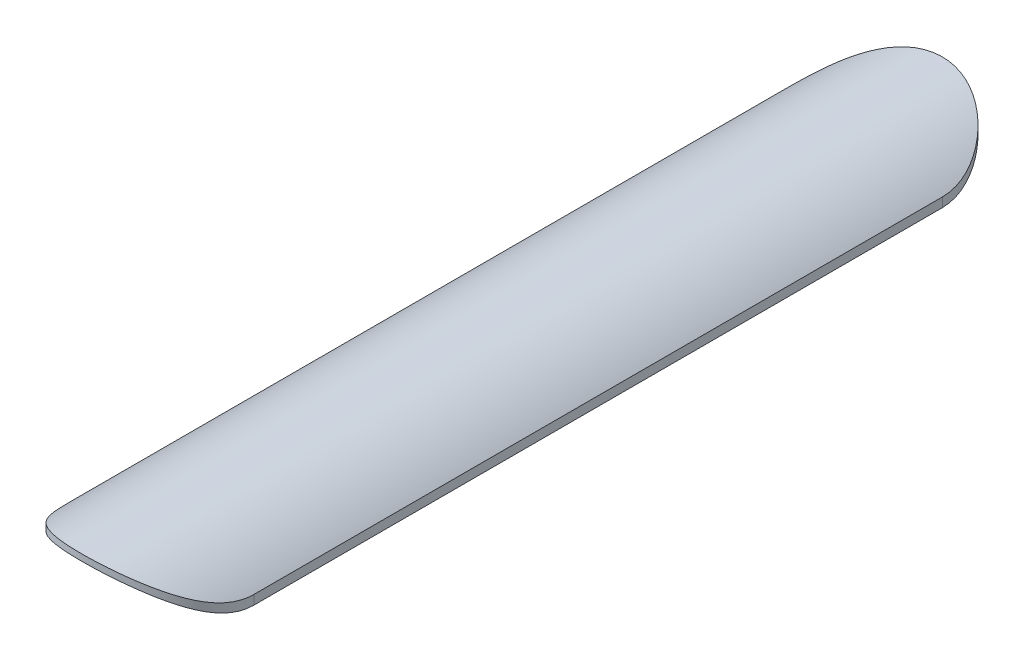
ISO-10303-21;
HEADER;
FILE_DESCRIPTION(('STEP AP214'),'2;1');
FILE_NAME('part.step','',(''),(''),'','','');
FILE_SCHEMA(('AUTOMOTIVE_DESIGN { 1 0 10303 214 1 1 1 1 }'));
ENDSEC;
DATA;
#1=APPLICATION_CONTEXT('core data for automotive mechanical design processes');
#2=APPLICATION_PROTOCOL_DEFINITION('international standard','automotive_design',2000,#1);
#3=PRODUCT_CONTEXT('',#1,'mechanical');
#4=PRODUCT('Part','Part','',(#3));
#5=PRODUCT_RELATED_PRODUCT_CATEGORY('part','',(#4));
#6=PRODUCT_DEFINITION_FORMATION('','',#4);
#7=PRODUCT_DEFINITION_CONTEXT('part definition',#1,'design');
#8=PRODUCT_DEFINITION('design','',#6,#7);
#9=PRODUCT_DEFINITION_SHAPE('','',#8);
#10=(LENGTH_UNIT() NAMED_UNIT(*) SI_UNIT(.MILLI.,.METRE.));
#11=(NAMED_UNIT(*) PLANE_ANGLE_UNIT() SI_UNIT($,.RADIAN.));
#12=(NAMED_UNIT(*) SI_UNIT($,.STERADIAN.) SOLID_ANGLE_UNIT());
#13=UNCERTAINTY_MEASURE_WITH_UNIT(LENGTH_MEASURE(1.E-05),#10,'distance_accuracy_value','');
#14=(GEOMETRIC_REPRESENTATION_CONTEXT(3) GLOBAL_UNCERTAINTY_ASSIGNED_CONTEXT((#13)) GLOBAL_UNIT_ASSIGNED_CONTEXT((#10,
#11,#12)) REPRESENTATION_CONTEXT('',''));
#15=CARTESIAN_POINT('',(0.,0.,0.));
#16=DIRECTION('',(0.,0.,1.));
#17=DIRECTION('',(1.,0.,0.));
#18=AXIS2_PLACEMENT_3D('',#15,#16,#17);
#19=CARTESIAN_POINT('',(39.9999999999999,-0.01,-160.));
#20=DIRECTION('',(1.,0.,0.));
#21=DIRECTION('',(0.,0.,-1.));
#22=AXIS2_PLACEMENT_3D('',#19,#20,#21);
#23=PLANE('',#22);
#24=DIRECTION('',(0.,1.,0.));
#25=VECTOR('',#24,1.);
#26=CARTESIAN_POINT('',(40.,-0.01,160.));
#27=LINE('',#26,#25);
#28=CARTESIAN_POINT('',(40.,36.2767142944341,160.));
#29=VERTEX_POINT('',#28);
#30=CARTESIAN_POINT('',(40.,40.6078810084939,160.));
#31=VERTEX_POINT('',#30);
#32=EDGE_CURVE('E11',#29,#31,#27,.T.);
#33=ORIENTED_EDGE('',*,*,#32,.F.);
#34=DIRECTION('',(0.,0.,-1.));
#35=VECTOR('',#34,1.);
#36=CARTESIAN_POINT('',(40.,36.2767142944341,210.));
#37=LINE('',#36,#35);
#38=CARTESIAN_POINT('',(40.,36.2767142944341,-160.));
#39=VERTEX_POINT('',#38);
#40=EDGE_CURVE('E43',#29,#39,#37,.T.);
#41=ORIENTED_EDGE('',*,*,#40,.T.);
#42=DIRECTION('',(0.,1.,0.));
#43=VECTOR('',#42,1.);
#44=CARTESIAN_POINT('',(39.9999999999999,-0.01,-160.));
#45=LINE('',#44,#43);
#46=CARTESIAN_POINT('',(40.,40.6078810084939,-160.));
#47=VERTEX_POINT('',#46);
#48=EDGE_CURVE('E48',#39,#47,#45,.T.);
#49=ORIENTED_EDGE('',*,*,#48,.T.);
#50=DIRECTION('',(0.,0.,-1.));
#51=VECTOR('',#50,1.);
#52=CARTESIAN_POINT('',(40.,40.6078810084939,210.));
#53=LINE('',#52,#51);
#54=EDGE_CURVE('E91',#31,#47,#53,.T.);
#55=ORIENTED_EDGE('',*,*,#54,.F.);
#56=EDGE_LOOP('',(#33,#41,#49,#55));
#57=FACE_BOUND('',#56,.T.);
#58=ADVANCED_FACE('F38',(#57),#23,.T.);
#59=CARTESIAN_POINT('',(0.,-0.01,160.));
#60=DIRECTION('',(0.,1.,0.));
#61=DIRECTION('',(0.,0.,1.));
#62=AXIS2_PLACEMENT_3D('',#59,#60,#61);
#63=CYLINDRICAL_SURFACE('',#62,39.9999999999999);
#64=DIRECTION('',(0.,1.,0.));
#65=VECTOR('',#64,1.);
#66=CARTESIAN_POINT('',(-39.9999999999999,-0.01,160.));
#67=LINE('',#66,#65);
#68=CARTESIAN_POINT('',(-39.9999999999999,36.2767142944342,160.));
#69=VERTEX_POINT('',#68);
#70=CARTESIAN_POINT('',(-39.9999999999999,40.607881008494,160.));
#71=VERTEX_POINT('',#70);
#72=EDGE_CURVE('E90',#69,#71,#67,.T.);
#73=ORIENTED_EDGE('',*,*,#72,.F.);
#74=CARTESIAN_POINT('',(-39.9999999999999,36.2767142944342,160.));
#75=CARTESIAN_POINT('',(-40.000020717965,36.2766645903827,160.473687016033));
#76=CARTESIAN_POINT('',(-39.9915863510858,36.2859908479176,160.947353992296));
#77=CARTESIAN_POINT('',(-39.957964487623,36.3230259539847,161.893301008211));
#78=CARTESIAN_POINT('',(-39.9327796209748,36.350731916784,162.3655812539));
#79=CARTESIAN_POINT('',(-39.8658784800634,36.4240862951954,163.306646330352));
#80=CARTESIAN_POINT('',(-39.8241942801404,36.4696998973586,163.775436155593));
#81=CARTESIAN_POINT('',(-39.7245963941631,36.5781604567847,164.709250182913));
#82=CARTESIAN_POINT('',(-39.6666822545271,36.6410078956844,165.174274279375));
#83=CARTESIAN_POINT('',(-39.4707656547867,36.852350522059,166.55052914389));
#84=CARTESIAN_POINT('',(-39.3097131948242,37.0246287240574,167.455007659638));
#85=CARTESIAN_POINT('',(-38.9290721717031,37.4246322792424,169.239077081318));
#86=CARTESIAN_POINT('',(-38.7094571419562,37.6523826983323,170.118656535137));
#87=CARTESIAN_POINT('',(-38.2173113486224,38.1517880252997,171.842043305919));
#88=CARTESIAN_POINT('',(-37.9452014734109,38.4230910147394,172.686074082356));
#89=CARTESIAN_POINT('',(-37.35035469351,39.0015770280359,174.343154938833));
#90=CARTESIAN_POINT('',(-37.0276224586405,39.3087567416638,175.156207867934));
#91=CARTESIAN_POINT('',(-36.3331078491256,39.951594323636,176.753089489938));
#92=CARTESIAN_POINT('',(-35.9611610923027,40.2873462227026,177.536808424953));
#93=CARTESIAN_POINT('',(-35.1712586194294,40.9787528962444,179.071645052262));
#94=CARTESIAN_POINT('',(-34.7532959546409,41.334410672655,179.822757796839));
#95=CARTESIAN_POINT('',(-33.7846568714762,42.1315227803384,181.439557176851));
#96=CARTESIAN_POINT('',(-33.2241843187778,42.5758642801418,182.297963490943));
#97=CARTESIAN_POINT('',(-32.0414501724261,43.4729413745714,183.966460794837));
#98=CARTESIAN_POINT('',(-31.4191837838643,43.9256776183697,184.776548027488));
#99=CARTESIAN_POINT('',(-30.1140009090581,44.8305457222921,186.347489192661));
#100=CARTESIAN_POINT('',(-29.4310551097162,45.2826771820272,187.108319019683));
#101=CARTESIAN_POINT('',(-28.0058869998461,46.1776840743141,188.578283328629));
#102=CARTESIAN_POINT('',(-27.2636599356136,46.6205587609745,189.287413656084));
#103=CARTESIAN_POINT('',(-25.5686410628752,47.5748683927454,190.785786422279));
#104=CARTESIAN_POINT('',(-24.6032145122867,48.0825687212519,191.56318976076));
#105=CARTESIAN_POINT('',(-22.5910829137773,49.0601010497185,193.033236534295));
#106=CARTESIAN_POINT('',(-21.5443602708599,49.5299248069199,193.725861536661));
#107=CARTESIAN_POINT('',(-19.9179652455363,50.1957938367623,194.693979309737));
#108=CARTESIAN_POINT('',(-19.3668369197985,50.4111409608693,195.004697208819));
#109=CARTESIAN_POINT('',(-18.2461904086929,50.8274888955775,195.601677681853));
#110=CARTESIAN_POINT('',(-17.6766733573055,51.0284905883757,195.887941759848));
#111=CARTESIAN_POINT('',(-16.520479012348,51.4144436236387,196.434632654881));
#112=CARTESIAN_POINT('',(-15.9338114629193,51.5994038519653,196.695073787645));
#113=CARTESIAN_POINT('',(-14.7439936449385,51.9518987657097,197.189107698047));
#114=CARTESIAN_POINT('',(-14.140839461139,52.1194292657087,197.422694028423));
#115=CARTESIAN_POINT('',(-12.6701463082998,52.5000579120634,197.951313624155));
#116=CARTESIAN_POINT('',(-11.7951592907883,52.7038528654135,198.232523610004));
#117=CARTESIAN_POINT('',(-10.0199170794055,53.0699739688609,198.735667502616));
#118=CARTESIAN_POINT('',(-9.11966783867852,53.2323097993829,198.957615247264));
#119=CARTESIAN_POINT('',(-7.75481333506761,53.4422579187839,199.243841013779));
#120=CARTESIAN_POINT('',(-7.29753258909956,53.5066393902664,199.33145530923));
#121=CARTESIAN_POINT('',(-6.37885071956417,53.6239189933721,199.490854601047));
#122=CARTESIAN_POINT('',(-5.91745037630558,53.6768192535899,199.562642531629));
#123=CARTESIAN_POINT('',(-4.52803406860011,53.8178675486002,199.753873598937));
#124=CARTESIAN_POINT('',(-3.59471361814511,53.8883768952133,199.8492027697));
#125=CARTESIAN_POINT('',(-1.71904107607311,53.9808217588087,199.974127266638));
#126=CARTESIAN_POINT('',(-0.776672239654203,54.0026354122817,200.003557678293));
#127=CARTESIAN_POINT('',(1.10766545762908,53.9968573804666,199.995757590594));
#128=CARTESIAN_POINT('',(2.04963432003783,53.9692658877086,199.958527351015));
#129=CARTESIAN_POINT('',(3.92607611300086,53.8652874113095,199.817978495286));
#130=CARTESIAN_POINT('',(4.86054745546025,53.788890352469,199.714646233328));
#131=CARTESIAN_POINT('',(6.71493345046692,53.5889855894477,199.443475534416));
#132=CARTESIAN_POINT('',(7.63484817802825,53.4654781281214,199.27563742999));
#133=CARTESIAN_POINT('',(9.42459627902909,53.1786788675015,198.884302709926));
#134=CARTESIAN_POINT('',(10.2950884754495,53.016796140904,198.662772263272));
#135=CARTESIAN_POINT('',(12.0117523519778,52.6544149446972,198.164337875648));
#136=CARTESIAN_POINT('',(12.8579247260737,52.4539175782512,197.887435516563));
#137=CARTESIAN_POINT('',(14.5220186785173,52.017794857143,197.281299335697));
#138=CARTESIAN_POINT('',(15.3399376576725,51.7821662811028,196.952060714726));
#139=CARTESIAN_POINT('',(16.9442676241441,51.279611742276,196.244456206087));
#140=CARTESIAN_POINT('',(17.7306767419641,51.0126839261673,195.866087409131));
#141=CARTESIAN_POINT('',(19.3536202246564,50.4208554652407,195.019481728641));
#142=CARTESIAN_POINT('',(20.1862403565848,50.0928072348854,194.545942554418));
#143=CARTESIAN_POINT('',(21.8071787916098,49.4087141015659,193.546294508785));
#144=CARTESIAN_POINT('',(22.5954943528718,49.0526674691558,193.020182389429));
#145=CARTESIAN_POINT('',(24.1266023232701,48.3179938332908,191.918601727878));
#146=CARTESIAN_POINT('',(24.8693637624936,47.939351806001,191.343100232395));
#147=CARTESIAN_POINT('',(26.3075829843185,47.1654331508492,190.146086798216));
#148=CARTESIAN_POINT('',(27.0030385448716,46.770155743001,189.52457270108));
#149=CARTESIAN_POINT('',(28.4758226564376,45.8911565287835,188.113335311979));
#150=CARTESIAN_POINT('',(29.2429221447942,45.4051318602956,187.314346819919));
#151=CARTESIAN_POINT('',(30.7071230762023,44.4280027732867,185.657268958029));
#152=CARTESIAN_POINT('',(31.4042106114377,43.9368973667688,184.799167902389));
#153=CARTESIAN_POINT('',(32.7271828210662,42.9605385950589,183.025139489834));
#154=CARTESIAN_POINT('',(33.3530035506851,42.4752908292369,182.109161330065));
#155=CARTESIAN_POINT('',(34.5302239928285,41.5239199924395,180.221293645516));
#156=CARTESIAN_POINT('',(35.0816420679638,41.0577922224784,179.249418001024));
#157=CARTESIAN_POINT('',(36.0012344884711,40.2517649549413,177.455867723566));
#158=CARTESIAN_POINT('',(36.3837807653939,39.9056074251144,176.644358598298));
#159=CARTESIAN_POINT('',(37.0972436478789,39.2432336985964,174.986940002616));
#160=CARTESIAN_POINT('',(37.4281601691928,38.9270175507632,174.141030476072));
#161=CARTESIAN_POINT('',(38.0338649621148,38.3354103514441,172.419895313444));
#162=CARTESIAN_POINT('',(38.308889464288,38.0598488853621,171.544812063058));
#163=CARTESIAN_POINT('',(38.8008221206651,37.5582202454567,169.764631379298));
#164=CARTESIAN_POINT('',(39.0177499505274,37.3321363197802,168.859544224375));
#165=CARTESIAN_POINT('',(39.3336238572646,36.9986710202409,167.300325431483));
#166=CARTESIAN_POINT('',(39.4484300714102,36.8760415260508,166.652622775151));
#167=CARTESIAN_POINT('',(39.6464642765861,36.6630479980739,165.347280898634));
#168=CARTESIAN_POINT('',(39.7297010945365,36.5726749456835,164.689644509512));
#169=CARTESIAN_POINT('',(39.8640709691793,36.4261705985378,163.362154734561));
#170=CARTESIAN_POINT('',(39.9149578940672,36.3703019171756,162.692246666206));
#171=CARTESIAN_POINT('',(39.9659367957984,36.3142457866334,161.684428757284));
#172=CARTESIAN_POINT('',(39.978704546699,36.3001848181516,161.347843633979));
#173=CARTESIAN_POINT('',(39.9957376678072,36.2814147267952,160.674183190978));
#174=CARTESIAN_POINT('',(40.0000026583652,36.2767060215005,160.337107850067));
#175=CARTESIAN_POINT('',(40.,36.2767142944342,160.));
#176=B_SPLINE_CURVE_WITH_KNOTS('',3,(#74,#75,#76,#77,#78,#79,#80,#81,#82,#83,#84,#85,#86,#87,
#88,#89,#90,#91,#92,#93,#94,#95,#96,#97,#98,#99,#100,#101,#102,#103,#104,#105,#106,#107,#108,
#109,#110,#111,#112,#113,#114,#115,#116,#117,#118,#119,#120,#121,#122,#123,#124,#125,#126,#127,
#128,#129,#130,#131,#132,#133,#134,#135,#136,#137,#138,#139,#140,#141,#142,#143,#144,#145,#146,
#147,#148,#149,#150,#151,#152,#153,#154,#155,#156,#157,#158,#159,#160,#161,#162,#163,#164,#165,
#166,#167,#168,#169,#170,#171,#172,#173,#174,#175),.UNSPECIFIED.,.F.,.F.,(4,2,2,2,2,2,2,2,2,2,2,
2,2,2,2,2,2,2,2,2,2,2,2,2,2,2,2,2,2,2,2,2,2,2,2,2,2,2,2,2,2,2,2,2,2,2,2,2,2,2,4),(0.,
1.4208605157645,2.84149799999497,4.25938725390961,5.6773161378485,8.47692551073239,
11.2778022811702,14.057091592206,16.8361246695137,19.6246860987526,22.4136692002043,
25.7627011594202,29.1119931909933,32.4629120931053,35.8140999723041,39.8271596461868,
43.841090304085,45.8453685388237,47.8495234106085,49.8525609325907,51.8560783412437,
54.6771846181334,57.4976315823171,58.907344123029,60.3167950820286,63.1354213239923,
65.961093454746,68.7867545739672,71.6129991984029,74.439229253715,77.1744570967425,
79.9096068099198,82.6450074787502,85.3805702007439,88.415087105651,91.4497915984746,
94.4865368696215,97.5234246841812,101.148469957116,104.774233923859,108.40322592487,
112.031320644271,114.913998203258,117.796680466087,120.666913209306,123.536172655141,
125.542128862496,127.547523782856,129.56799954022,130.579154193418,131.590353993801),.UNSPECIFIED.);
#177=EDGE_CURVE('E98',#69,#29,#176,.T.);
#178=ORIENTED_EDGE('',*,*,#177,.T.);
#179=ORIENTED_EDGE('',*,*,#32,.T.);
#180=CARTESIAN_POINT('',(-39.9999999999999,40.607881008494,160.));
#181=CARTESIAN_POINT('',(-40.0000187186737,40.6078393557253,160.483392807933));
#182=CARTESIAN_POINT('',(-39.9912379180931,40.6165113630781,160.966768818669));
#183=CARTESIAN_POINT('',(-39.9562189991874,40.6509737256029,161.932219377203));
#184=CARTESIAN_POINT('',(-39.9299830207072,40.6767619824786,162.414294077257));
#185=CARTESIAN_POINT('',(-39.8602501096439,40.7450944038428,163.375239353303));
#186=CARTESIAN_POINT('',(-39.816780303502,40.7876122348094,163.854113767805));
#187=CARTESIAN_POINT('',(-39.7128568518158,40.8888030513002,164.808265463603));
#188=CARTESIAN_POINT('',(-39.652402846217,40.9474763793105,165.28354266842));
#189=CARTESIAN_POINT('',(-39.4475653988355,41.145180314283,166.69195585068));
#190=CARTESIAN_POINT('',(-39.2789000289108,41.3067025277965,167.61858839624));
#191=CARTESIAN_POINT('',(-38.8796024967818,41.6827454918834,169.447415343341));
#192=CARTESIAN_POINT('',(-38.6489482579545,41.8972851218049,170.349600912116));
#193=CARTESIAN_POINT('',(-38.1309075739,42.3692785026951,172.119350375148));
#194=CARTESIAN_POINT('',(-37.8438853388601,42.6264551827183,172.987095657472));
#195=CARTESIAN_POINT('',(-37.2155911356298,43.1760796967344,174.690964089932));
#196=CARTESIAN_POINT('',(-36.8743227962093,43.4685251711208,175.527089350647));
#197=CARTESIAN_POINT('',(-36.1393390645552,44.0814901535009,177.168555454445));
#198=CARTESIAN_POINT('',(-35.7454693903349,44.4020912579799,177.973796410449));
#199=CARTESIAN_POINT('',(-34.9084548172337,45.0631142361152,179.549836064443));
#200=CARTESIAN_POINT('',(-34.4653029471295,45.403538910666,180.320629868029));
#201=CARTESIAN_POINT('',(-33.4500380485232,46.1580072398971,181.958566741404));
#202=CARTESIAN_POINT('',(-32.868922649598,46.5745186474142,182.819003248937));
#203=CARTESIAN_POINT('',(-31.6437412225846,47.4154606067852,184.489729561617));
#204=CARTESIAN_POINT('',(-30.9996706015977,47.839891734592,185.300015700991));
#205=CARTESIAN_POINT('',(-29.6500849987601,48.6878615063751,186.869009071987));
#206=CARTESIAN_POINT('',(-28.9445410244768,49.1113996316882,187.627691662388));
#207=CARTESIAN_POINT('',(-27.4738156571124,49.9490315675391,189.090638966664));
#208=CARTESIAN_POINT('',(-26.7086301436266,50.3631247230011,189.794899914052));
#209=CARTESIAN_POINT('',(-24.9864198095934,51.2422113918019,191.259605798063));
#210=CARTESIAN_POINT('',(-24.0187887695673,51.7040334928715,192.009540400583));
#211=CARTESIAN_POINT('',(-22.0071335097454,52.5917692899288,193.424506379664));
#212=CARTESIAN_POINT('',(-20.9630951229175,53.0176762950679,194.089521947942));
#213=CARTESIAN_POINT('',(-19.3446920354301,53.6200919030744,195.016697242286));
#214=CARTESIAN_POINT('',(-18.7968250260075,53.8147230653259,195.313882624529));
#215=CARTESIAN_POINT('',(-17.6841574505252,54.1905449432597,195.883995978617));
#216=CARTESIAN_POINT('',(-17.1193593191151,54.3717375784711,196.156927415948));
#217=CARTESIAN_POINT('',(-15.9738941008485,54.7192179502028,196.677381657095));
#218=CARTESIAN_POINT('',(-15.393231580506,54.8855099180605,196.924911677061));
#219=CARTESIAN_POINT('',(-14.2170853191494,55.2018605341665,197.393518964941));
#220=CARTESIAN_POINT('',(-13.621602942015,55.3519206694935,197.614598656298));
#221=CARTESIAN_POINT('',(-12.1405785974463,55.6993746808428,198.124394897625));
#222=CARTESIAN_POINT('',(-11.2472931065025,55.8869021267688,198.39761270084));
#223=CARTESIAN_POINT('',(-9.43677619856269,56.2209445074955,198.882198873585));
#224=CARTESIAN_POINT('',(-8.51954905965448,56.3674667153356,199.093578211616));
#225=CARTESIAN_POINT('',(-6.6672418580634,56.6164320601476,199.451704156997));
#226=CARTESIAN_POINT('',(-5.73217395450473,56.7189041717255,199.598493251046));
#227=CARTESIAN_POINT('',(-3.85005162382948,56.8776668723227,199.825564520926));
#228=CARTESIAN_POINT('',(-2.90299679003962,56.9339558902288,199.905844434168));
#229=CARTESIAN_POINT('',(-1.00204992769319,56.9991412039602,199.998790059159));
#230=CARTESIAN_POINT('',(-0.0481480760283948,57.0079434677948,200.011321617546));
#231=CARTESIAN_POINT('',(1.85734227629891,56.9776995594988,199.968218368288));
#232=CARTESIAN_POINT('',(2.8089307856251,56.9386535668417,199.912583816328));
#233=CARTESIAN_POINT('',(4.70284822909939,56.8135911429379,199.733967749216));
#234=CARTESIAN_POINT('',(5.64517492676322,56.7275636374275,199.610970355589));
#235=CARTESIAN_POINT('',(7.51360958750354,56.5104440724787,199.299398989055));
#236=CARTESIAN_POINT('',(8.43971754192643,56.3793519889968,199.110824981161));
#237=CARTESIAN_POINT('',(10.2483153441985,56.0784529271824,198.67579277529));
#238=CARTESIAN_POINT('',(11.1313187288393,55.9096201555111,198.430787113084));
#239=CARTESIAN_POINT('',(12.8712494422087,55.5348804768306,197.883541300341));
#240=CARTESIAN_POINT('',(13.7281773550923,55.3289744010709,197.581302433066));
#241=CARTESIAN_POINT('',(15.4120264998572,54.8837676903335,196.922714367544));
#242=CARTESIAN_POINT('',(16.2389459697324,54.644465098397,196.566361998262));
#243=CARTESIAN_POINT('',(17.8595627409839,54.1364693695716,195.802773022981));
#244=CARTESIAN_POINT('',(18.6532580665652,53.8677744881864,195.395533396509));
#245=CARTESIAN_POINT('',(20.2919590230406,53.2736209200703,194.484935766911));
#246=CARTESIAN_POINT('',(21.1327384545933,52.9451756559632,193.975920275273));
#247=CARTESIAN_POINT('',(22.7675461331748,52.2630227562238,192.902813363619));
#248=CARTESIAN_POINT('',(23.5615714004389,51.9093135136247,192.338718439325));
#249=CARTESIAN_POINT('',(25.1016839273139,51.1823330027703,191.158427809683));
#250=CARTESIAN_POINT('',(25.8477260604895,50.8090439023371,190.542184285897));
#251=CARTESIAN_POINT('',(27.2896186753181,50.0493845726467,189.261014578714));
#252=CARTESIAN_POINT('',(27.9854667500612,49.6630137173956,188.596086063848));
#253=CARTESIAN_POINT('',(29.4459124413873,48.8136632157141,187.096520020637));
#254=CARTESIAN_POINT('',(30.2004737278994,48.3493663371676,186.252827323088));
#255=CARTESIAN_POINT('',(31.6360612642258,47.4224611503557,184.503876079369));
#256=CARTESIAN_POINT('',(32.3170722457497,46.9598532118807,183.598604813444));
#257=CARTESIAN_POINT('',(33.6029282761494,46.0484987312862,181.728578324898));
#258=CARTESIAN_POINT('',(34.2077604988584,45.5997545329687,180.763813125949));
#259=CARTESIAN_POINT('',(35.3374609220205,44.7299868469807,178.776826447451));
#260=CARTESIAN_POINT('',(35.862354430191,44.3089546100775,177.754623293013));
#261=CARTESIAN_POINT('',(36.7162835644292,43.6021477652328,175.8967089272));
#262=CARTESIAN_POINT('',(37.0625860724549,43.3075538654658,175.072263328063));
#263=CARTESIAN_POINT('',(37.702293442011,42.7518023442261,173.391973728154));
#264=CARTESIAN_POINT('',(37.9956986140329,42.4906445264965,172.536129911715));
#265=CARTESIAN_POINT('',(38.5254559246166,42.0109111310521,170.798670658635));
#266=CARTESIAN_POINT('',(38.7620006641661,41.7921923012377,169.917153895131));
#267=CARTESIAN_POINT('',(39.1758641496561,41.404497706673,168.129708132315));
#268=CARTESIAN_POINT('',(39.353208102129,41.2355007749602,167.22378970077));
#269=CARTESIAN_POINT('',(39.5818880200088,41.0156922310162,165.792080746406));
#270=CARTESIAN_POINT('',(39.6544674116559,40.9454608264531,165.272531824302));
#271=CARTESIAN_POINT('',(39.7793024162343,40.8241925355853,164.228847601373));
#272=CARTESIAN_POINT('',(39.8315627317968,40.7731512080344,163.704713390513));
#273=CARTESIAN_POINT('',(39.9155352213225,40.6909535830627,162.651415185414));
#274=CARTESIAN_POINT('',(39.9471758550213,40.6598665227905,162.122240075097));
#275=CARTESIAN_POINT('',(39.9894258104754,40.6182960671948,161.062051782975));
#276=CARTESIAN_POINT('',(40.0000273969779,40.6078202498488,160.53103799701));
#277=CARTESIAN_POINT('',(40.,40.6078810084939,160.));
#278=B_SPLINE_CURVE_WITH_KNOTS('',3,(#180,#181,#182,#183,#184,#185,#186,#187,#188,#189,#190,
#191,#192,#193,#194,#195,#196,#197,#198,#199,#200,#201,#202,#203,#204,#205,#206,#207,#208,#209,
#210,#211,#212,#213,#214,#215,#216,#217,#218,#219,#220,#221,#222,#223,#224,#225,#226,#227,#228,
#229,#230,#231,#232,#233,#234,#235,#236,#237,#238,#239,#240,#241,#242,#243,#244,#245,#246,#247,
#248,#249,#250,#251,#252,#253,#254,#255,#256,#257,#258,#259,#260,#261,#262,#263,#264,#265,#266,
#267,#268,#269,#270,#271,#272,#273,#274,#275,#276,#277),.UNSPECIFIED.,.F.,.F.,(4,2,2,2,2,2,2,2,
2,2,2,2,2,2,2,2,2,2,2,2,2,2,2,2,2,2,2,2,2,2,2,2,2,2,2,2,2,2,2,2,2,2,2,2,2,2,2,2,4),(0.,
1.44999242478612,2.89980712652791,4.34734878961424,5.7949211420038,8.65728056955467,
11.5206607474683,14.3661148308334,17.2113786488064,20.0651789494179,22.9193834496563,
26.2724497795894,29.625760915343,32.9806622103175,36.3357954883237,40.2559312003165,
44.1767956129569,46.1350119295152,48.0929479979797,50.0503262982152,52.0075251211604,
54.8625974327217,57.7171630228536,60.5698480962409,63.422630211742,66.2810592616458,
69.1394775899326,71.9985699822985,74.8576639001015,77.6500783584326,80.442430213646,
83.2349457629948,86.0276271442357,89.1334603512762,92.2394912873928,95.3484018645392,
98.457461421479,102.123849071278,105.790996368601,109.458760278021,113.12536058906,
115.947555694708,118.769734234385,121.582214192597,124.393495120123,125.980665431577,
127.567468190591,129.159747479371,130.752612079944),.UNSPECIFIED.);
#279=EDGE_CURVE('E124',#71,#31,#278,.T.);
#280=ORIENTED_EDGE('',*,*,#279,.F.);
#281=EDGE_LOOP('',(#73,#178,#179,#280));
#282=FACE_BOUND('',#281,.T.);
#283=ADVANCED_FACE('F115',(#282),#63,.T.);
#284=CARTESIAN_POINT('',(0.,-0.01,-160.));
#285=DIRECTION('',(0.,1.,0.));
#286=DIRECTION('',(0.,0.,1.));
#287=AXIS2_PLACEMENT_3D('',#284,#285,#286);
#288=CYLINDRICAL_SURFACE('',#287,39.9999999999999);
#289=ORIENTED_EDGE('',*,*,#48,.F.);
#290=CARTESIAN_POINT('',(39.9999999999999,36.2767142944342,-160.));
#291=CARTESIAN_POINT('',(40.000020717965,36.2766645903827,-160.473687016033));
#292=CARTESIAN_POINT('',(39.9915863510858,36.2859908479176,-160.947353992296));
#293=CARTESIAN_POINT('',(39.957964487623,36.3230259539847,-161.893301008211));
#294=CARTESIAN_POINT('',(39.9327796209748,36.350731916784,-162.3655812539));
#295=CARTESIAN_POINT('',(39.8658784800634,36.4240862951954,-163.306646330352));
#296=CARTESIAN_POINT('',(39.8241942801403,36.4696998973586,-163.775436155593));
#297=CARTESIAN_POINT('',(39.7245963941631,36.5781604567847,-164.709250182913));
#298=CARTESIAN_POINT('',(39.6666822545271,36.6410078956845,-165.174274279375));
#299=CARTESIAN_POINT('',(39.4707656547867,36.852350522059,-166.55052914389));
#300=CARTESIAN_POINT('',(39.3097131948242,37.0246287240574,-167.455007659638));
#301=CARTESIAN_POINT('',(38.9290721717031,37.4246322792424,-169.239077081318));
#302=CARTESIAN_POINT('',(38.7094571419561,37.6523826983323,-170.118656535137));
#303=CARTESIAN_POINT('',(38.2173113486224,38.1517880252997,-171.842043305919));
#304=CARTESIAN_POINT('',(37.9452014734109,38.4230910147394,-172.686074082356));
#305=CARTESIAN_POINT('',(37.35035469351,39.0015770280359,-174.343154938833));
#306=CARTESIAN_POINT('',(37.0276224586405,39.3087567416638,-175.156207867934));
#307=CARTESIAN_POINT('',(36.3331078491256,39.951594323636,-176.753089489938));
#308=CARTESIAN_POINT('',(35.9611610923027,40.2873462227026,-177.536808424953));
#309=CARTESIAN_POINT('',(35.1712586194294,40.9787528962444,-179.071645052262));
#310=CARTESIAN_POINT('',(34.7532959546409,41.334410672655,-179.822757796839));
#311=CARTESIAN_POINT('',(33.7846568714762,42.1315227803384,-181.439557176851));
#312=CARTESIAN_POINT('',(33.2241843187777,42.5758642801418,-182.297963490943));
#313=CARTESIAN_POINT('',(32.0414501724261,43.4729413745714,-183.966460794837));
#314=CARTESIAN_POINT('',(31.4191837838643,43.9256776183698,-184.776548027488));
#315=CARTESIAN_POINT('',(30.1140009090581,44.8305457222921,-186.347489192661));
#316=CARTESIAN_POINT('',(29.4310551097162,45.2826771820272,-187.108319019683));
#317=CARTESIAN_POINT('',(28.0058869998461,46.1776840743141,-188.578283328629));
#318=CARTESIAN_POINT('',(27.2636599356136,46.6205587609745,-189.287413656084));
#319=CARTESIAN_POINT('',(25.5686410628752,47.5748683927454,-190.785786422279));
#320=CARTESIAN_POINT('',(24.6032145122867,48.0825687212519,-191.56318976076));
#321=CARTESIAN_POINT('',(22.5910829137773,49.0601010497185,-193.033236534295));
#322=CARTESIAN_POINT('',(21.5443602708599,49.5299248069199,-193.725861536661));
#323=CARTESIAN_POINT('',(19.9179652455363,50.1957938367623,-194.693979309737));
#324=CARTESIAN_POINT('',(19.3668369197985,50.4111409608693,-195.004697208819));
#325=CARTESIAN_POINT('',(18.2461904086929,50.8274888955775,-195.601677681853));
#326=CARTESIAN_POINT('',(17.6766733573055,51.0284905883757,-195.887941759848));
#327=CARTESIAN_POINT('',(16.5204790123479,51.4144436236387,-196.434632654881));
#328=CARTESIAN_POINT('',(15.9338114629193,51.5994038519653,-196.695073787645));
#329=CARTESIAN_POINT('',(14.7439936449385,51.9518987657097,-197.189107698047));
#330=CARTESIAN_POINT('',(14.140839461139,52.1194292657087,-197.422694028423));
#331=CARTESIAN_POINT('',(12.6701463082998,52.5000579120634,-197.951313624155));
#332=CARTESIAN_POINT('',(11.7951592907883,52.7038528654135,-198.232523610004));
#333=CARTESIAN_POINT('',(10.0199170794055,53.0699739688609,-198.735667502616));
#334=CARTESIAN_POINT('',(9.11966783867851,53.2323097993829,-198.957615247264));
#335=CARTESIAN_POINT('',(7.75481333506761,53.4422579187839,-199.243841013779));
#336=CARTESIAN_POINT('',(7.29753258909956,53.5066393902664,-199.33145530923));
#337=CARTESIAN_POINT('',(6.37885071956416,53.6239189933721,-199.490854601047));
#338=CARTESIAN_POINT('',(5.91745037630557,53.6768192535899,-199.562642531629));
#339=CARTESIAN_POINT('',(4.52803406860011,53.8178675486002,-199.753873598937));
#340=CARTESIAN_POINT('',(3.59471361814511,53.8883768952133,-199.8492027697));
#341=CARTESIAN_POINT('',(1.7190410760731,53.9808217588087,-199.974127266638));
#342=CARTESIAN_POINT('',(0.776672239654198,54.0026354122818,-200.003557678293));
#343=CARTESIAN_POINT('',(-1.10766545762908,53.9968573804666,-199.995757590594));
#344=CARTESIAN_POINT('',(-2.04963432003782,53.9692658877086,-199.958527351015));
#345=CARTESIAN_POINT('',(-3.92607611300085,53.8652874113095,-199.817978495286));
#346=CARTESIAN_POINT('',(-4.86054745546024,53.788890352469,-199.714646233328));
#347=CARTESIAN_POINT('',(-6.71493345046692,53.5889855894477,-199.443475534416));
#348=CARTESIAN_POINT('',(-7.63484817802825,53.4654781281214,-199.27563742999));
#349=CARTESIAN_POINT('',(-9.42459627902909,53.1786788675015,-198.884302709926));
#350=CARTESIAN_POINT('',(-10.2950884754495,53.0167961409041,-198.662772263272));
#351=CARTESIAN_POINT('',(-12.0117523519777,52.6544149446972,-198.164337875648));
#352=CARTESIAN_POINT('',(-12.8579247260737,52.4539175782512,-197.887435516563));
#353=CARTESIAN_POINT('',(-14.5220186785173,52.0177948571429,-197.281299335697));
#354=CARTESIAN_POINT('',(-15.3399376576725,51.7821662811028,-196.952060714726));
#355=CARTESIAN_POINT('',(-16.9442676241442,51.279611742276,-196.244456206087));
#356=CARTESIAN_POINT('',(-17.7306767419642,51.0126839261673,-195.866087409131));
#357=CARTESIAN_POINT('',(-19.3536202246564,50.4208554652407,-195.019481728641));
#358=CARTESIAN_POINT('',(-20.1862403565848,50.0928072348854,-194.545942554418));
#359=CARTESIAN_POINT('',(-21.8071787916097,49.4087141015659,-193.546294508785));
#360=CARTESIAN_POINT('',(-22.5954943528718,49.0526674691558,-193.020182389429));
#361=CARTESIAN_POINT('',(-24.1266023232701,48.3179938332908,-191.918601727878));
#362=CARTESIAN_POINT('',(-24.8693637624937,47.939351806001,-191.343100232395));
#363=CARTESIAN_POINT('',(-26.3075829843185,47.1654331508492,-190.146086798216));
#364=CARTESIAN_POINT('',(-27.0030385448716,46.770155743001,-189.52457270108));
#365=CARTESIAN_POINT('',(-28.4758226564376,45.8911565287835,-188.113335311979));
#366=CARTESIAN_POINT('',(-29.2429221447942,45.4051318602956,-187.314346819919));
#367=CARTESIAN_POINT('',(-30.7071230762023,44.4280027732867,-185.657268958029));
#368=CARTESIAN_POINT('',(-31.4042106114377,43.9368973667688,-184.799167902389));
#369=CARTESIAN_POINT('',(-32.7271828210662,42.9605385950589,-183.025139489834));
#370=CARTESIAN_POINT('',(-33.3530035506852,42.4752908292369,-182.109161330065));
#371=CARTESIAN_POINT('',(-34.5302239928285,41.5239199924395,-180.221293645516));
#372=CARTESIAN_POINT('',(-35.0816420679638,41.0577922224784,-179.249418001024));
#373=CARTESIAN_POINT('',(-36.0012344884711,40.2517649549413,-177.455867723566));
#374=CARTESIAN_POINT('',(-36.3837807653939,39.9056074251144,-176.644358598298));
#375=CARTESIAN_POINT('',(-37.0972436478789,39.2432336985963,-174.986940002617));
#376=CARTESIAN_POINT('',(-37.4281601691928,38.9270175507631,-174.141030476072));
#377=CARTESIAN_POINT('',(-38.0338649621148,38.335410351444,-172.419895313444));
#378=CARTESIAN_POINT('',(-38.308889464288,38.0598488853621,-171.544812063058));
#379=CARTESIAN_POINT('',(-38.8008221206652,37.5582202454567,-169.764631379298));
#380=CARTESIAN_POINT('',(-39.0177499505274,37.3321363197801,-168.859544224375));
#381=CARTESIAN_POINT('',(-39.3336238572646,36.9986710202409,-167.300325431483));
#382=CARTESIAN_POINT('',(-39.4484300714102,36.8760415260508,-166.652622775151));
#383=CARTESIAN_POINT('',(-39.6464642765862,36.6630479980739,-165.347280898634));
#384=CARTESIAN_POINT('',(-39.7297010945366,36.5726749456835,-164.689644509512));
#385=CARTESIAN_POINT('',(-39.8640709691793,36.4261705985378,-163.362154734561));
#386=CARTESIAN_POINT('',(-39.9149578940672,36.3703019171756,-162.692246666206));
#387=CARTESIAN_POINT('',(-39.9659367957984,36.3142457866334,-161.684428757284));
#388=CARTESIAN_POINT('',(-39.978704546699,36.3001848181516,-161.347843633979));
#389=CARTESIAN_POINT('',(-39.9957376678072,36.2814147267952,-160.674183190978));
#390=CARTESIAN_POINT('',(-40.0000026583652,36.2767060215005,-160.337107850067));
#391=CARTESIAN_POINT('',(-40.,36.2767142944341,-160.));
#392=B_SPLINE_CURVE_WITH_KNOTS('',3,(#290,#291,#292,#293,#294,#295,#296,#297,#298,#299,#300,
#301,#302,#303,#304,#305,#306,#307,#308,#309,#310,#311,#312,#313,#314,#315,#316,#317,#318,#319,
#320,#321,#322,#323,#324,#325,#326,#327,#328,#329,#330,#331,#332,#333,#334,#335,#336,#337,#338,
#339,#340,#341,#342,#343,#344,#345,#346,#347,#348,#349,#350,#351,#352,#353,#354,#355,#356,#357,
#358,#359,#360,#361,#362,#363,#364,#365,#366,#367,#368,#369,#370,#371,#372,#373,#374,#375,#376,
#377,#378,#379,#380,#381,#382,#383,#384,#385,#386,#387,#388,#389,#390,#391),.UNSPECIFIED.,.F.,
.F.,(4,2,2,2,2,2,2,2,2,2,2,2,2,2,2,2,2,2,2,2,2,2,2,2,2,2,2,2,2,2,2,2,2,2,2,2,2,2,2,2,2,2,2,2,2,
2,2,2,2,2,4),(0.,1.4208605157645,2.84149799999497,4.25938725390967,5.6773161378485,
8.47692551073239,11.2778022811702,14.057091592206,16.8361246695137,19.6246860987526,
22.4136692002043,25.7627011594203,29.1119931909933,32.4629120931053,35.8140999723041,
39.8271596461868,43.841090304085,45.8453685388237,47.8495234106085,49.8525609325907,
51.8560783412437,54.6771846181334,57.4976315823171,58.907344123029,60.3167950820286,
63.1354213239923,65.961093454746,68.7867545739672,71.6129991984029,74.439229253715,
77.1744570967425,79.9096068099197,82.6450074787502,85.3805702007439,88.415087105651,
91.4497915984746,94.4865368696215,97.5234246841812,101.148469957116,104.774233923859,
108.40322592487,112.031320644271,114.913998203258,117.796680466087,120.666913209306,
123.536172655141,125.542128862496,127.547523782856,129.56799954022,130.579154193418,
131.590353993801),.UNSPECIFIED.);
#393=CARTESIAN_POINT('',(-39.9999999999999,36.2767142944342,-160.));
#394=VERTEX_POINT('',#393);
#395=EDGE_CURVE('E97',#39,#394,#392,.T.);
#396=ORIENTED_EDGE('',*,*,#395,.T.);
#397=DIRECTION('',(0.,1.,0.));
#398=VECTOR('',#397,1.);
#399=CARTESIAN_POINT('',(-40.,-0.01,-160.));
#400=LINE('',#399,#398);
#401=CARTESIAN_POINT('',(-39.9999999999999,40.607881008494,-160.));
#402=VERTEX_POINT('',#401);
#403=EDGE_CURVE('E80',#394,#402,#400,.T.);
#404=ORIENTED_EDGE('',*,*,#403,.T.);
#405=CARTESIAN_POINT('',(39.9999999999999,40.607881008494,-160.));
#406=CARTESIAN_POINT('',(40.0000187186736,40.6078393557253,-160.483392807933));
#407=CARTESIAN_POINT('',(39.9912379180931,40.6165113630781,-160.966768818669));
#408=CARTESIAN_POINT('',(39.9562189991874,40.6509737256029,-161.932219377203));
#409=CARTESIAN_POINT('',(39.9299830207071,40.6767619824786,-162.414294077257));
#410=CARTESIAN_POINT('',(39.8602501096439,40.7450944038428,-163.375239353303));
#411=CARTESIAN_POINT('',(39.816780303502,40.7876122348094,-163.854113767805));
#412=CARTESIAN_POINT('',(39.7128568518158,40.8888030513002,-164.808265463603));
#413=CARTESIAN_POINT('',(39.652402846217,40.9474763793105,-165.28354266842));
#414=CARTESIAN_POINT('',(39.4475653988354,41.145180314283,-166.69195585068));
#415=CARTESIAN_POINT('',(39.2789000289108,41.3067025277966,-167.61858839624));
#416=CARTESIAN_POINT('',(38.8796024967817,41.6827454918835,-169.447415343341));
#417=CARTESIAN_POINT('',(38.6489482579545,41.8972851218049,-170.349600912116));
#418=CARTESIAN_POINT('',(38.1309075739,42.3692785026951,-172.119350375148));
#419=CARTESIAN_POINT('',(37.8438853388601,42.6264551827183,-172.987095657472));
#420=CARTESIAN_POINT('',(37.2155911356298,43.1760796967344,-174.690964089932));
#421=CARTESIAN_POINT('',(36.8743227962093,43.4685251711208,-175.527089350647));
#422=CARTESIAN_POINT('',(36.1393390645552,44.081490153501,-177.168555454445));
#423=CARTESIAN_POINT('',(35.7454693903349,44.4020912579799,-177.973796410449));
#424=CARTESIAN_POINT('',(34.9084548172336,45.0631142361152,-179.549836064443));
#425=CARTESIAN_POINT('',(34.4653029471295,45.4035389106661,-180.320629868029));
#426=CARTESIAN_POINT('',(33.4500380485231,46.1580072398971,-181.958566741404));
#427=CARTESIAN_POINT('',(32.8689226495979,46.5745186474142,-182.819003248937));
#428=CARTESIAN_POINT('',(31.6437412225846,47.4154606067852,-184.489729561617));
#429=CARTESIAN_POINT('',(30.9996706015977,47.8398917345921,-185.300015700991));
#430=CARTESIAN_POINT('',(29.6500849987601,48.6878615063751,-186.869009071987));
#431=CARTESIAN_POINT('',(28.9445410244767,49.1113996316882,-187.627691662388));
#432=CARTESIAN_POINT('',(27.4738156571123,49.9490315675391,-189.090638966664));
#433=CARTESIAN_POINT('',(26.7086301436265,50.3631247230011,-189.794899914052));
#434=CARTESIAN_POINT('',(24.9864198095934,51.2422113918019,-191.259605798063));
#435=CARTESIAN_POINT('',(24.0187887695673,51.7040334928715,-192.009540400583));
#436=CARTESIAN_POINT('',(22.0071335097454,52.5917692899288,-193.424506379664));
#437=CARTESIAN_POINT('',(20.9630951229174,53.017676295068,-194.089521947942));
#438=CARTESIAN_POINT('',(19.3446920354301,53.6200919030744,-195.016697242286));
#439=CARTESIAN_POINT('',(18.7968250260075,53.8147230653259,-195.313882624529));
#440=CARTESIAN_POINT('',(17.6841574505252,54.1905449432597,-195.883995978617));
#441=CARTESIAN_POINT('',(17.1193593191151,54.3717375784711,-196.156927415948));
#442=CARTESIAN_POINT('',(15.9738941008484,54.7192179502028,-196.677381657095));
#443=CARTESIAN_POINT('',(15.3932315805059,54.8855099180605,-196.924911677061));
#444=CARTESIAN_POINT('',(14.2170853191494,55.2018605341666,-197.393518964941));
#445=CARTESIAN_POINT('',(13.621602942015,55.3519206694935,-197.614598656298));
#446=CARTESIAN_POINT('',(12.1405785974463,55.6993746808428,-198.124394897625));
#447=CARTESIAN_POINT('',(11.2472931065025,55.8869021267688,-198.39761270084));
#448=CARTESIAN_POINT('',(9.43677619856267,56.2209445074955,-198.882198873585));
#449=CARTESIAN_POINT('',(8.51954905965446,56.3674667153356,-199.093578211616));
#450=CARTESIAN_POINT('',(6.66724185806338,56.6164320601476,-199.451704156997));
#451=CARTESIAN_POINT('',(5.73217395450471,56.7189041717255,-199.598493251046));
#452=CARTESIAN_POINT('',(3.85005162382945,56.8776668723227,-199.825564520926));
#453=CARTESIAN_POINT('',(2.90299679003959,56.9339558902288,-199.905844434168));
#454=CARTESIAN_POINT('',(1.00204992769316,56.9991412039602,-199.998790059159));
#455=CARTESIAN_POINT('',(0.0481480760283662,57.0079434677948,-200.011321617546));
#456=CARTESIAN_POINT('',(-1.85734227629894,56.9776995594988,-199.968218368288));
#457=CARTESIAN_POINT('',(-2.80893078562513,56.9386535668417,-199.912583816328));
#458=CARTESIAN_POINT('',(-4.70284822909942,56.8135911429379,-199.733967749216));
#459=CARTESIAN_POINT('',(-5.64517492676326,56.7275636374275,-199.610970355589));
#460=CARTESIAN_POINT('',(-7.51360958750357,56.5104440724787,-199.299398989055));
#461=CARTESIAN_POINT('',(-8.43971754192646,56.3793519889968,-199.11082498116));
#462=CARTESIAN_POINT('',(-10.2483153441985,56.0784529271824,-198.67579277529));
#463=CARTESIAN_POINT('',(-11.1313187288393,55.9096201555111,-198.430787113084));
#464=CARTESIAN_POINT('',(-12.8712494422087,55.5348804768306,-197.883541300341));
#465=CARTESIAN_POINT('',(-13.7281773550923,55.3289744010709,-197.581302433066));
#466=CARTESIAN_POINT('',(-15.4120264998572,54.8837676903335,-196.922714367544));
#467=CARTESIAN_POINT('',(-16.2389459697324,54.644465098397,-196.566361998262));
#468=CARTESIAN_POINT('',(-17.8595627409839,54.1364693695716,-195.802773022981));
#469=CARTESIAN_POINT('',(-18.6532580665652,53.8677744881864,-195.395533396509));
#470=CARTESIAN_POINT('',(-20.2919590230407,53.2736209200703,-194.484935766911));
#471=CARTESIAN_POINT('',(-21.1327384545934,52.9451756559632,-193.975920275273));
#472=CARTESIAN_POINT('',(-22.7675461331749,52.2630227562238,-192.902813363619));
#473=CARTESIAN_POINT('',(-23.5615714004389,51.9093135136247,-192.338718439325));
#474=CARTESIAN_POINT('',(-25.1016839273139,51.1823330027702,-191.158427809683));
#475=CARTESIAN_POINT('',(-25.8477260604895,50.8090439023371,-190.542184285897));
#476=CARTESIAN_POINT('',(-27.2896186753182,50.0493845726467,-189.261014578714));
#477=CARTESIAN_POINT('',(-27.9854667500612,49.6630137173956,-188.596086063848));
#478=CARTESIAN_POINT('',(-29.4459124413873,48.8136632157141,-187.096520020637));
#479=CARTESIAN_POINT('',(-30.2004737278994,48.3493663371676,-186.252827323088));
#480=CARTESIAN_POINT('',(-31.6360612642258,47.4224611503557,-184.503876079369));
#481=CARTESIAN_POINT('',(-32.3170722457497,46.9598532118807,-183.598604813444));
#482=CARTESIAN_POINT('',(-33.6029282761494,46.0484987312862,-181.728578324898));
#483=CARTESIAN_POINT('',(-34.2077604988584,45.5997545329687,-180.763813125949));
#484=CARTESIAN_POINT('',(-35.3374609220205,44.7299868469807,-178.776826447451));
#485=CARTESIAN_POINT('',(-35.862354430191,44.3089546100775,-177.754623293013));
#486=CARTESIAN_POINT('',(-36.7162835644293,43.6021477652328,-175.8967089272));
#487=CARTESIAN_POINT('',(-37.0625860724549,43.3075538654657,-175.072263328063));
#488=CARTESIAN_POINT('',(-37.702293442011,42.7518023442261,-173.391973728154));
#489=CARTESIAN_POINT('',(-37.9956986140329,42.4906445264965,-172.536129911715));
#490=CARTESIAN_POINT('',(-38.5254559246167,42.010911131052,-170.798670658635));
#491=CARTESIAN_POINT('',(-38.7620006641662,41.7921923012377,-169.917153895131));
#492=CARTESIAN_POINT('',(-39.1758641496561,41.404497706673,-168.129708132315));
#493=CARTESIAN_POINT('',(-39.353208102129,41.2355007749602,-167.22378970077));
#494=CARTESIAN_POINT('',(-39.5818880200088,41.0156922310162,-165.792080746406));
#495=CARTESIAN_POINT('',(-39.6544674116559,40.9454608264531,-165.272531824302));
#496=CARTESIAN_POINT('',(-39.7793024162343,40.8241925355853,-164.228847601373));
#497=CARTESIAN_POINT('',(-39.8315627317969,40.7731512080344,-163.704713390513));
#498=CARTESIAN_POINT('',(-39.9155352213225,40.6909535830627,-162.651415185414));
#499=CARTESIAN_POINT('',(-39.9471758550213,40.6598665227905,-162.122240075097));
#500=CARTESIAN_POINT('',(-39.9894258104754,40.6182960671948,-161.062051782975));
#501=CARTESIAN_POINT('',(-40.0000273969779,40.6078202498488,-160.53103799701));
#502=CARTESIAN_POINT('',(-40.,40.6078810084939,-160.));
#503=B_SPLINE_CURVE_WITH_KNOTS('',3,(#405,#406,#407,#408,#409,#410,#411,#412,#413,#414,#415,
#416,#417,#418,#419,#420,#421,#422,#423,#424,#425,#426,#427,#428,#429,#430,#431,#432,#433,#434,
#435,#436,#437,#438,#439,#440,#441,#442,#443,#444,#445,#446,#447,#448,#449,#450,#451,#452,#453,
#454,#455,#456,#457,#458,#459,#460,#461,#462,#463,#464,#465,#466,#467,#468,#469,#470,#471,#472,
#473,#474,#475,#476,#477,#478,#479,#480,#481,#482,#483,#484,#485,#486,#487,#488,#489,#490,#491,
#492,#493,#494,#495,#496,#497,#498,#499,#500,#501,#502),.UNSPECIFIED.,.F.,.F.,(4,2,2,2,2,2,2,2,
2,2,2,2,2,2,2,2,2,2,2,2,2,2,2,2,2,2,2,2,2,2,2,2,2,2,2,2,2,2,2,2,2,2,2,2,2,2,2,2,4),(0.,
1.44999242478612,2.89980712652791,4.34734878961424,5.7949211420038,8.65728056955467,
11.5206607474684,14.3661148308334,17.2113786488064,20.0651789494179,22.9193834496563,
26.2724497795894,29.625760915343,32.9806622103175,36.3357954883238,40.2559312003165,
44.176795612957,46.1350119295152,48.0929479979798,50.0503262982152,52.0075251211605,
54.8625974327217,57.7171630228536,60.5698480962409,63.422630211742,66.2810592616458,
69.1394775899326,71.9985699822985,74.8576639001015,77.6500783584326,80.442430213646,
83.2349457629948,86.0276271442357,89.1334603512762,92.2394912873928,95.3484018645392,
98.457461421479,102.123849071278,105.790996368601,109.458760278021,113.12536058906,
115.947555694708,118.769734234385,121.582214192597,124.393495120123,125.980665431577,
127.567468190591,129.159747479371,130.752612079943),.UNSPECIFIED.);
#504=EDGE_CURVE('E101',#47,#402,#503,.T.);
#505=ORIENTED_EDGE('',*,*,#504,.F.);
#506=EDGE_LOOP('',(#289,#396,#404,#505));
#507=FACE_BOUND('',#506,.T.);
#508=ADVANCED_FACE('F100',(#507),#288,.T.);
#509=CARTESIAN_POINT('',(-40.,-0.01,-160.));
#510=DIRECTION('',(-1.,0.,0.));
#511=DIRECTION('',(0.,0.,1.));
#512=AXIS2_PLACEMENT_3D('',#509,#510,#511);
#513=PLANE('',#512);
#514=ORIENTED_EDGE('',*,*,#403,.F.);
#515=DIRECTION('',(0.,0.,-1.));
#516=VECTOR('',#515,1.);
#517=CARTESIAN_POINT('',(-39.9999999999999,36.2767142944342,210.));
#518=LINE('',#517,#516);
#519=EDGE_CURVE('E83',#394,#69,#518,.F.);
#520=ORIENTED_EDGE('',*,*,#519,.T.);
#521=ORIENTED_EDGE('',*,*,#72,.T.);
#522=DIRECTION('',(0.,0.,-1.));
#523=VECTOR('',#522,1.);
#524=CARTESIAN_POINT('',(-39.9999999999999,40.607881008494,210.));
#525=LINE('',#524,#523);
#526=EDGE_CURVE('E85',#402,#71,#525,.F.);
#527=ORIENTED_EDGE('',*,*,#526,.F.);
#528=EDGE_LOOP('',(#514,#520,#521,#527));
#529=FACE_BOUND('',#528,.T.);
#530=ADVANCED_FACE('F82',(#529),#513,.T.);
#531=CARTESIAN_POINT('',(0.,0.,210.));
#532=DIRECTION('',(0.,0.,-1.));
#533=DIRECTION('',(-1.,0.,0.));
#534=AXIS2_PLACEMENT_3D('',#531,#532,#533);
#535=CYLINDRICAL_SURFACE('',#534,57.);
#536=ORIENTED_EDGE('',*,*,#54,.T.);
#537=ORIENTED_EDGE('',*,*,#504,.T.);
#538=ORIENTED_EDGE('',*,*,#526,.T.);
#539=ORIENTED_EDGE('',*,*,#279,.T.);
#540=EDGE_LOOP('',(#536,#537,#538,#539));
#541=FACE_BOUND('',#540,.T.);
#542=ADVANCED_FACE('F117',(#541),#535,.T.);
#543=CARTESIAN_POINT('',(0.,0.,210.));
#544=DIRECTION('',(0.,0.,-1.));
#545=DIRECTION('',(-1.,0.,0.));
#546=AXIS2_PLACEMENT_3D('',#543,#544,#545);
#547=CYLINDRICAL_SURFACE('',#546,54.);
#548=ORIENTED_EDGE('',*,*,#395,.F.);
#549=ORIENTED_EDGE('',*,*,#40,.F.);
#550=ORIENTED_EDGE('',*,*,#177,.F.);
#551=ORIENTED_EDGE('',*,*,#519,.F.);
#552=EDGE_LOOP('',(#548,#549,#550,#551));
#553=FACE_BOUND('',#552,.T.);
#554=ADVANCED_FACE('F40',(#553),#547,.F.);
#555=CLOSED_SHELL('',(#58,#283,#508,#530,#542,#554));
#556=MANIFOLD_SOLID_BREP('B2',#555);
#557=ADVANCED_BREP_SHAPE_REPRESENTATION('',(#18,#556),#14);
#558=SHAPE_DEFINITION_REPRESENTATION(#9,#557);
ENDSEC;
END-ISO-10303-21;
